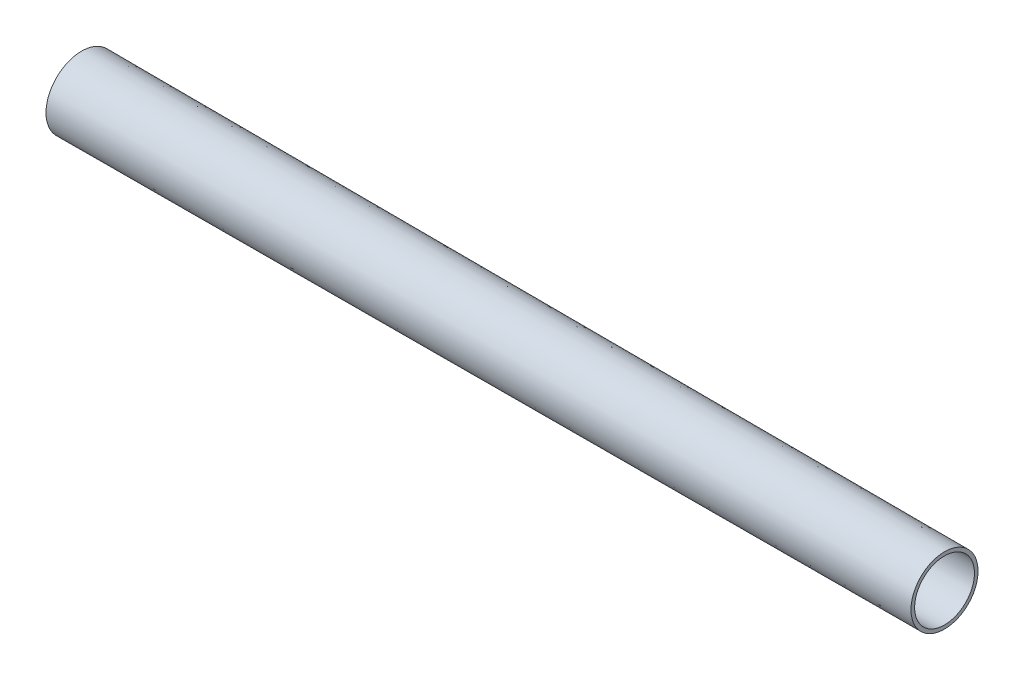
ISO-10303-21;
HEADER;
FILE_DESCRIPTION(('STEP AP214'),'2;1');
FILE_NAME('part.step','',(''),(''),'','','');
FILE_SCHEMA(('AUTOMOTIVE_DESIGN { 1 0 10303 214 1 1 1 1 }'));
ENDSEC;
DATA;
#1=APPLICATION_CONTEXT('core data for automotive mechanical design processes');
#2=APPLICATION_PROTOCOL_DEFINITION('international standard','automotive_design',2000,#1);
#3=PRODUCT_CONTEXT('',#1,'mechanical');
#4=PRODUCT('Part','Part','',(#3));
#5=PRODUCT_RELATED_PRODUCT_CATEGORY('part','',(#4));
#6=PRODUCT_DEFINITION_FORMATION('','',#4);
#7=PRODUCT_DEFINITION_CONTEXT('part definition',#1,'design');
#8=PRODUCT_DEFINITION('design','',#6,#7);
#9=PRODUCT_DEFINITION_SHAPE('','',#8);
#10=(LENGTH_UNIT() NAMED_UNIT(*) SI_UNIT(.MILLI.,.METRE.));
#11=(NAMED_UNIT(*) PLANE_ANGLE_UNIT() SI_UNIT($,.RADIAN.));
#12=(NAMED_UNIT(*) SI_UNIT($,.STERADIAN.) SOLID_ANGLE_UNIT());
#13=UNCERTAINTY_MEASURE_WITH_UNIT(LENGTH_MEASURE(1.E-05),#10,'distance_accuracy_value','');
#14=(GEOMETRIC_REPRESENTATION_CONTEXT(3) GLOBAL_UNCERTAINTY_ASSIGNED_CONTEXT((#13)) GLOBAL_UNIT_ASSIGNED_CONTEXT((#10,
#11,#12)) REPRESENTATION_CONTEXT('',''));
#15=CARTESIAN_POINT('',(0.,0.,0.));
#16=DIRECTION('',(0.,0.,1.));
#17=DIRECTION('',(1.,0.,0.));
#18=AXIS2_PLACEMENT_3D('',#15,#16,#17);
#19=CARTESIAN_POINT('',(34.29,0.,0.));
#20=DIRECTION('',(-1.,0.,0.));
#21=DIRECTION('',(0.,0.,1.));
#22=AXIS2_PLACEMENT_3D('',#19,#20,#21);
#23=CONICAL_SURFACE('',#22,8.94404255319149,0.00238894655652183);
#24=CARTESIAN_POINT('',(275.59,0.,0.));
#25=DIRECTION('',(-1.,0.,0.));
#26=DIRECTION('',(0.,0.,1.));
#27=AXIS2_PLACEMENT_3D('',#24,#25,#26);
#28=CIRCLE('',#27,8.36758865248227);
#29=CARTESIAN_POINT('',(275.59,0.,8.36758865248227));
#30=VERTEX_POINT('',#29);
#31=EDGE_CURVE('E10',#30,#30,#28,.T.);
#32=ORIENTED_EDGE('',*,*,#31,.F.);
#33=EDGE_LOOP('',(#32));
#34=FACE_BOUND('',#33,.T.);
#35=CARTESIAN_POINT('',(34.29,0.,0.));
#36=DIRECTION('',(-1.,0.,0.));
#37=DIRECTION('',(0.,0.,1.));
#38=AXIS2_PLACEMENT_3D('',#35,#36,#37);
#39=CIRCLE('',#38,8.94404255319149);
#40=CARTESIAN_POINT('',(34.29,0.,8.94404255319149));
#41=VERTEX_POINT('',#40);
#42=EDGE_CURVE('E47',#41,#41,#39,.T.);
#43=ORIENTED_EDGE('',*,*,#42,.T.);
#44=EDGE_LOOP('',(#43));
#45=FACE_BOUND('',#44,.T.);
#46=ADVANCED_FACE('F33',(#34,#45),#23,.F.);
#47=CARTESIAN_POINT('',(275.59,8.36758865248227,0.));
#48=DIRECTION('',(-1.,0.,0.));
#49=DIRECTION('',(0.,0.,1.));
#50=AXIS2_PLACEMENT_3D('',#47,#48,#49);
#51=PLANE('',#50);
#52=CARTESIAN_POINT('',(275.59,0.,0.));
#53=DIRECTION('',(-1.,0.,0.));
#54=DIRECTION('',(0.,0.,1.));
#55=AXIS2_PLACEMENT_3D('',#52,#53,#54);
#56=CIRCLE('',#55,9.3763829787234);
#57=CARTESIAN_POINT('',(275.59,0.,9.3763829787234));
#58=VERTEX_POINT('',#57);
#59=EDGE_CURVE('E39',#58,#58,#56,.T.);
#60=ORIENTED_EDGE('',*,*,#59,.F.);
#61=EDGE_LOOP('',(#60));
#62=FACE_BOUND('',#61,.T.);
#63=ORIENTED_EDGE('',*,*,#31,.T.);
#64=EDGE_LOOP('',(#63));
#65=FACE_BOUND('',#64,.T.);
#66=ADVANCED_FACE('F62',(#62,#65),#51,.F.);
#67=CARTESIAN_POINT('',(275.59,0.,0.));
#68=DIRECTION('',(-1.,0.,0.));
#69=DIRECTION('',(0.,0.,1.));
#70=AXIS2_PLACEMENT_3D('',#67,#68,#69);
#71=CONICAL_SURFACE('',#70,9.3763829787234,0.00238894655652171);
#72=CARTESIAN_POINT('',(34.29,0.,0.));
#73=DIRECTION('',(-1.,0.,0.));
#74=DIRECTION('',(0.,0.,1.));
#75=AXIS2_PLACEMENT_3D('',#72,#73,#74);
#76=CIRCLE('',#75,9.95283687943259);
#77=CARTESIAN_POINT('',(34.29,0.,9.95283687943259));
#78=VERTEX_POINT('',#77);
#79=EDGE_CURVE('E43',#78,#78,#76,.T.);
#80=ORIENTED_EDGE('',*,*,#79,.F.);
#81=EDGE_LOOP('',(#80));
#82=FACE_BOUND('',#81,.T.);
#83=ORIENTED_EDGE('',*,*,#59,.T.);
#84=EDGE_LOOP('',(#83));
#85=FACE_BOUND('',#84,.T.);
#86=ADVANCED_FACE('F57',(#82,#85),#71,.T.);
#87=CARTESIAN_POINT('',(34.29,9.95283687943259,0.));
#88=DIRECTION('',(1.,0.,0.));
#89=DIRECTION('',(0.,0.,-1.));
#90=AXIS2_PLACEMENT_3D('',#87,#88,#89);
#91=PLANE('',#90);
#92=ORIENTED_EDGE('',*,*,#42,.F.);
#93=EDGE_LOOP('',(#92));
#94=FACE_BOUND('',#93,.T.);
#95=ORIENTED_EDGE('',*,*,#79,.T.);
#96=EDGE_LOOP('',(#95));
#97=FACE_BOUND('',#96,.T.);
#98=ADVANCED_FACE('F54',(#94,#97),#91,.F.);
#99=CLOSED_SHELL('',(#46,#66,#86,#98));
#100=MANIFOLD_SOLID_BREP('B2',#99);
#101=ADVANCED_BREP_SHAPE_REPRESENTATION('',(#18,#100),#14);
#102=SHAPE_DEFINITION_REPRESENTATION(#9,#101);
ENDSEC;
END-ISO-10303-21;
